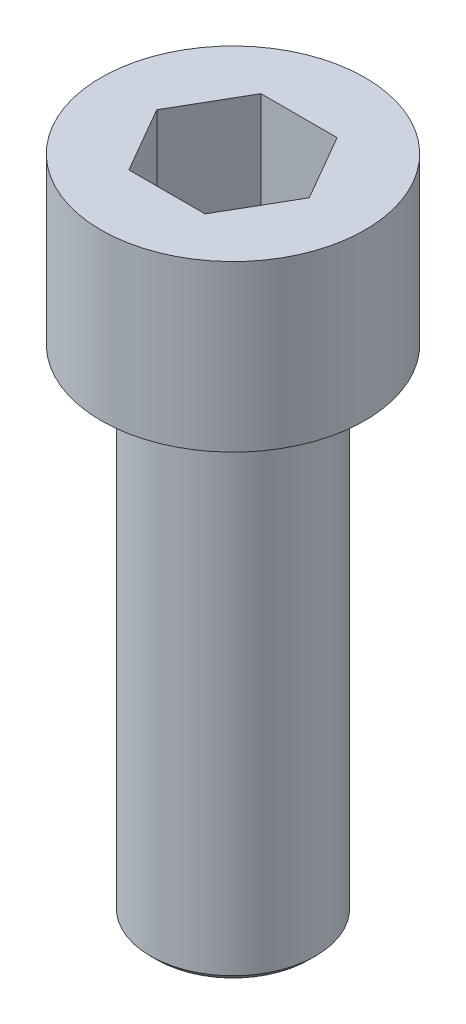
ISO-10303-21;
HEADER;
FILE_DESCRIPTION(('STEP AP214'),'2;1');
FILE_NAME('part.step','',(''),(''),'','','');
FILE_SCHEMA(('AUTOMOTIVE_DESIGN { 1 0 10303 214 1 1 1 1 }'));
ENDSEC;
DATA;
#1=APPLICATION_CONTEXT('core data for automotive mechanical design processes');
#2=APPLICATION_PROTOCOL_DEFINITION('international standard','automotive_design',2000,#1);
#3=PRODUCT_CONTEXT('',#1,'mechanical');
#4=PRODUCT('Part','Part','',(#3));
#5=PRODUCT_RELATED_PRODUCT_CATEGORY('part','',(#4));
#6=PRODUCT_DEFINITION_FORMATION('','',#4);
#7=PRODUCT_DEFINITION_CONTEXT('part definition',#1,'design');
#8=PRODUCT_DEFINITION('design','',#6,#7);
#9=PRODUCT_DEFINITION_SHAPE('','',#8);
#10=(LENGTH_UNIT() NAMED_UNIT(*) SI_UNIT(.MILLI.,.METRE.));
#11=(NAMED_UNIT(*) PLANE_ANGLE_UNIT() SI_UNIT($,.RADIAN.));
#12=(NAMED_UNIT(*) SI_UNIT($,.STERADIAN.) SOLID_ANGLE_UNIT());
#13=UNCERTAINTY_MEASURE_WITH_UNIT(LENGTH_MEASURE(1.E-05),#10,'distance_accuracy_value','');
#14=(GEOMETRIC_REPRESENTATION_CONTEXT(3) GLOBAL_UNCERTAINTY_ASSIGNED_CONTEXT((#13)) GLOBAL_UNIT_ASSIGNED_CONTEXT((#10,
#11,#12)) REPRESENTATION_CONTEXT('',''));
#15=CARTESIAN_POINT('',(0.,0.,0.));
#16=DIRECTION('',(0.,0.,1.));
#17=DIRECTION('',(1.,0.,0.));
#18=AXIS2_PLACEMENT_3D('',#15,#16,#17);
#19=CARTESIAN_POINT('',(0.,0.,0.));
#20=DIRECTION('',(0.,1.,0.));
#21=DIRECTION('',(0.,0.,1.));
#22=AXIS2_PLACEMENT_3D('',#19,#20,#21);
#23=PLANE('',#22);
#24=CARTESIAN_POINT('',(0.,0.,0.));
#25=DIRECTION('',(0.,1.,0.));
#26=DIRECTION('',(0.,0.,1.));
#27=AXIS2_PLACEMENT_3D('',#24,#25,#26);
#28=CIRCLE('',#27,2.30000000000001);
#29=CARTESIAN_POINT('',(0.,0.,2.30000000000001));
#30=VERTEX_POINT('',#29);
#31=EDGE_CURVE('E11',#30,#30,#28,.F.);
#32=ORIENTED_EDGE('',*,*,#31,.T.);
#33=EDGE_LOOP('',(#32));
#34=FACE_BOUND('',#33,.T.);
#35=ADVANCED_FACE('F31',(#34),#23,.F.);
#36=CARTESIAN_POINT('',(0.,124.161982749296,0.));
#37=DIRECTION('',(0.,1.,0.));
#38=DIRECTION('',(0.,0.,1.));
#39=AXIS2_PLACEMENT_3D('',#36,#37,#38);
#40=CYLINDRICAL_SURFACE('',#39,2.50000000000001);
#41=CARTESIAN_POINT('',(0.,0.200000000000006,0.));
#42=DIRECTION('',(0.,1.,0.));
#43=DIRECTION('',(0.,0.,1.));
#44=AXIS2_PLACEMENT_3D('',#41,#42,#43);
#45=CIRCLE('',#44,2.50000000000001);
#46=CARTESIAN_POINT('',(0.,0.200000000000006,2.50000000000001));
#47=VERTEX_POINT('',#46);
#48=EDGE_CURVE('E39',#47,#47,#45,.T.);
#49=ORIENTED_EDGE('',*,*,#48,.T.);
#50=EDGE_LOOP('',(#49));
#51=FACE_BOUND('',#50,.T.);
#52=CARTESIAN_POINT('',(0.,14.8,0.));
#53=DIRECTION('',(0.,1.,0.));
#54=DIRECTION('',(0.,0.,1.));
#55=AXIS2_PLACEMENT_3D('',#52,#53,#54);
#56=CIRCLE('',#55,2.50000000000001);
#57=CARTESIAN_POINT('',(0.,14.8,2.50000000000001));
#58=VERTEX_POINT('',#57);
#59=EDGE_CURVE('E147',#58,#58,#56,.F.);
#60=ORIENTED_EDGE('',*,*,#59,.T.);
#61=EDGE_LOOP('',(#60));
#62=FACE_BOUND('',#61,.T.);
#63=ADVANCED_FACE('F152',(#51,#62),#40,.T.);
#64=CARTESIAN_POINT('',(-2.50000000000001,15.,0.));
#65=DIRECTION('',(0.,1.,0.));
#66=DIRECTION('',(0.,0.,1.));
#67=AXIS2_PLACEMENT_3D('',#64,#65,#66);
#68=PLANE('',#67);
#69=CARTESIAN_POINT('',(0.,15.,0.));
#70=DIRECTION('',(0.,1.,0.));
#71=DIRECTION('',(0.,0.,1.));
#72=AXIS2_PLACEMENT_3D('',#69,#70,#71);
#73=CIRCLE('',#72,2.70000000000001);
#74=CARTESIAN_POINT('',(0.,15.,2.70000000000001));
#75=VERTEX_POINT('',#74);
#76=EDGE_CURVE('E144',#75,#75,#73,.T.);
#77=ORIENTED_EDGE('',*,*,#76,.T.);
#78=EDGE_LOOP('',(#77));
#79=FACE_BOUND('',#78,.T.);
#80=CARTESIAN_POINT('',(0.,15.,0.));
#81=DIRECTION('',(0.,1.,0.));
#82=DIRECTION('',(0.,0.,1.));
#83=AXIS2_PLACEMENT_3D('',#80,#81,#82);
#84=CIRCLE('',#83,4.);
#85=CARTESIAN_POINT('',(0.,15.,4.));
#86=VERTEX_POINT('',#85);
#87=EDGE_CURVE('E141',#86,#86,#84,.T.);
#88=ORIENTED_EDGE('',*,*,#87,.F.);
#89=EDGE_LOOP('',(#88));
#90=FACE_BOUND('',#89,.T.);
#91=ADVANCED_FACE('F169',(#79,#90),#68,.F.);
#92=CARTESIAN_POINT('',(0.,124.161982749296,0.));
#93=DIRECTION('',(0.,1.,0.));
#94=DIRECTION('',(0.,0.,1.));
#95=AXIS2_PLACEMENT_3D('',#92,#93,#94);
#96=CYLINDRICAL_SURFACE('',#95,4.);
#97=CARTESIAN_POINT('',(0.,20.,0.));
#98=DIRECTION('',(0.,1.,0.));
#99=DIRECTION('',(0.,0.,1.));
#100=AXIS2_PLACEMENT_3D('',#97,#98,#99);
#101=CIRCLE('',#100,4.);
#102=CARTESIAN_POINT('',(0.,20.,4.));
#103=VERTEX_POINT('',#102);
#104=EDGE_CURVE('E133',#103,#103,#101,.T.);
#105=ORIENTED_EDGE('',*,*,#104,.F.);
#106=EDGE_LOOP('',(#105));
#107=FACE_BOUND('',#106,.T.);
#108=ORIENTED_EDGE('',*,*,#87,.T.);
#109=EDGE_LOOP('',(#108));
#110=FACE_BOUND('',#109,.T.);
#111=ADVANCED_FACE('F174',(#107,#110),#96,.T.);
#112=CARTESIAN_POINT('',(-4.,20.,0.));
#113=DIRECTION('',(0.,-1.,0.));
#114=DIRECTION('',(0.,0.,-1.));
#115=AXIS2_PLACEMENT_3D('',#112,#113,#114);
#116=PLANE('',#115);
#117=DIRECTION('',(-0.500000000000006,0.,-0.866025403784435));
#118=VECTOR('',#117,1.);
#119=CARTESIAN_POINT('',(2.30940107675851,20.,0.));
#120=LINE('',#119,#118);
#121=CARTESIAN_POINT('',(2.30940107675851,20.,0.));
#122=VERTEX_POINT('',#121);
#123=CARTESIAN_POINT('',(1.15470053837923,20.,-2.00000000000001));
#124=VERTEX_POINT('',#123);
#125=EDGE_CURVE('E120',#122,#124,#120,.T.);
#126=ORIENTED_EDGE('',*,*,#125,.F.);
#127=DIRECTION('',(0.499999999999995,0.,-0.866025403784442));
#128=VECTOR('',#127,1.);
#129=CARTESIAN_POINT('',(1.15470053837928,20.,1.99999999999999));
#130=LINE('',#129,#128);
#131=CARTESIAN_POINT('',(1.15470053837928,20.,1.99999999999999));
#132=VERTEX_POINT('',#131);
#133=EDGE_CURVE('E46',#132,#122,#130,.T.);
#134=ORIENTED_EDGE('',*,*,#133,.F.);
#135=DIRECTION('',(1.,0.,0.));
#136=VECTOR('',#135,1.);
#137=CARTESIAN_POINT('',(-1.15470053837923,20.,2.00000000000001));
#138=LINE('',#137,#136);
#139=CARTESIAN_POINT('',(-1.15470053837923,20.,2.00000000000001));
#140=VERTEX_POINT('',#139);
#141=EDGE_CURVE('E129',#140,#132,#138,.T.);
#142=ORIENTED_EDGE('',*,*,#141,.F.);
#143=DIRECTION('',(0.500000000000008,0.,0.866025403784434));
#144=VECTOR('',#143,1.);
#145=CARTESIAN_POINT('',(-2.3094010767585,20.,0.));
#146=LINE('',#145,#144);
#147=CARTESIAN_POINT('',(-2.3094010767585,20.,0.));
#148=VERTEX_POINT('',#147);
#149=EDGE_CURVE('E127',#148,#140,#146,.T.);
#150=ORIENTED_EDGE('',*,*,#149,.F.);
#151=DIRECTION('',(-0.499999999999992,0.,0.866025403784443));
#152=VECTOR('',#151,1.);
#153=CARTESIAN_POINT('',(-1.15470053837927,20.,-1.99999999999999));
#154=LINE('',#153,#152);
#155=CARTESIAN_POINT('',(-1.15470053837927,20.,-1.99999999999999));
#156=VERTEX_POINT('',#155);
#157=EDGE_CURVE('E94',#156,#148,#154,.T.);
#158=ORIENTED_EDGE('',*,*,#157,.F.);
#159=DIRECTION('',(-1.,0.,0.));
#160=VECTOR('',#159,1.);
#161=CARTESIAN_POINT('',(1.15470053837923,20.,-2.00000000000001));
#162=LINE('',#161,#160);
#163=EDGE_CURVE('E123',#124,#156,#162,.T.);
#164=ORIENTED_EDGE('',*,*,#163,.F.);
#165=EDGE_LOOP('',(#126,#134,#142,#150,#158,#164));
#166=FACE_BOUND('',#165,.T.);
#167=ORIENTED_EDGE('',*,*,#104,.T.);
#168=EDGE_LOOP('',(#167));
#169=FACE_BOUND('',#168,.T.);
#170=ADVANCED_FACE('F178',(#166,#169),#116,.F.);
#171=CARTESIAN_POINT('',(1.15470053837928,17.,1.99999999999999));
#172=DIRECTION('',(0.866025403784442,0.,0.499999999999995));
#173=DIRECTION('',(0.499999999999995,0.,-0.866025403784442));
#174=AXIS2_PLACEMENT_3D('',#171,#172,#173);
#175=PLANE('',#174);
#176=ORIENTED_EDGE('',*,*,#133,.T.);
#177=DIRECTION('',(0.,1.,0.));
#178=VECTOR('',#177,1.);
#179=CARTESIAN_POINT('',(2.30940107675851,17.,0.));
#180=LINE('',#179,#178);
#181=CARTESIAN_POINT('',(2.30940107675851,17.,0.));
#182=VERTEX_POINT('',#181);
#183=EDGE_CURVE('E76',#182,#122,#180,.T.);
#184=ORIENTED_EDGE('',*,*,#183,.F.);
#185=DIRECTION('',(0.499999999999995,0.,-0.866025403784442));
#186=VECTOR('',#185,1.);
#187=CARTESIAN_POINT('',(1.15470053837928,17.,1.99999999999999));
#188=LINE('',#187,#186);
#189=CARTESIAN_POINT('',(1.15470053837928,17.,1.99999999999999));
#190=VERTEX_POINT('',#189);
#191=EDGE_CURVE('E131',#190,#182,#188,.T.);
#192=ORIENTED_EDGE('',*,*,#191,.F.);
#193=DIRECTION('',(0.,1.,0.));
#194=VECTOR('',#193,1.);
#195=CARTESIAN_POINT('',(1.15470053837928,17.,1.99999999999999));
#196=LINE('',#195,#194);
#197=EDGE_CURVE('E54',#190,#132,#196,.T.);
#198=ORIENTED_EDGE('',*,*,#197,.T.);
#199=EDGE_LOOP('',(#176,#184,#192,#198));
#200=FACE_BOUND('',#199,.T.);
#201=ADVANCED_FACE('F182',(#200),#175,.F.);
#202=CARTESIAN_POINT('',(-1.15470053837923,17.,2.00000000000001));
#203=DIRECTION('',(0.,0.,1.));
#204=DIRECTION('',(1.,0.,0.));
#205=AXIS2_PLACEMENT_3D('',#202,#203,#204);
#206=PLANE('',#205);
#207=ORIENTED_EDGE('',*,*,#141,.T.);
#208=ORIENTED_EDGE('',*,*,#197,.F.);
#209=DIRECTION('',(1.,0.,0.));
#210=VECTOR('',#209,1.);
#211=CARTESIAN_POINT('',(-1.15470053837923,17.,2.00000000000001));
#212=LINE('',#211,#210);
#213=CARTESIAN_POINT('',(-1.15470053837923,17.,2.00000000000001));
#214=VERTEX_POINT('',#213);
#215=EDGE_CURVE('E106',#214,#190,#212,.T.);
#216=ORIENTED_EDGE('',*,*,#215,.F.);
#217=DIRECTION('',(0.,1.,0.));
#218=VECTOR('',#217,1.);
#219=CARTESIAN_POINT('',(-1.15470053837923,17.,2.00000000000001));
#220=LINE('',#219,#218);
#221=EDGE_CURVE('E98',#214,#140,#220,.T.);
#222=ORIENTED_EDGE('',*,*,#221,.T.);
#223=EDGE_LOOP('',(#207,#208,#216,#222));
#224=FACE_BOUND('',#223,.T.);
#225=ADVANCED_FACE('F186',(#224),#206,.F.);
#226=CARTESIAN_POINT('',(-2.3094010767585,17.,0.));
#227=DIRECTION('',(-0.866025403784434,0.,0.500000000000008));
#228=DIRECTION('',(0.500000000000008,0.,0.866025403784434));
#229=AXIS2_PLACEMENT_3D('',#226,#227,#228);
#230=PLANE('',#229);
#231=ORIENTED_EDGE('',*,*,#149,.T.);
#232=ORIENTED_EDGE('',*,*,#221,.F.);
#233=DIRECTION('',(0.500000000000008,0.,0.866025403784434));
#234=VECTOR('',#233,1.);
#235=CARTESIAN_POINT('',(-2.3094010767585,17.,0.));
#236=LINE('',#235,#234);
#237=CARTESIAN_POINT('',(-2.3094010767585,17.,0.));
#238=VERTEX_POINT('',#237);
#239=EDGE_CURVE('E102',#238,#214,#236,.T.);
#240=ORIENTED_EDGE('',*,*,#239,.F.);
#241=DIRECTION('',(0.,1.,0.));
#242=VECTOR('',#241,1.);
#243=CARTESIAN_POINT('',(-2.3094010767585,17.,0.));
#244=LINE('',#243,#242);
#245=EDGE_CURVE('E87',#238,#148,#244,.T.);
#246=ORIENTED_EDGE('',*,*,#245,.T.);
#247=EDGE_LOOP('',(#231,#232,#240,#246));
#248=FACE_BOUND('',#247,.T.);
#249=ADVANCED_FACE('F103',(#248),#230,.F.);
#250=CARTESIAN_POINT('',(-1.15470053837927,17.,-1.99999999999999));
#251=DIRECTION('',(-0.866025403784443,0.,-0.499999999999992));
#252=DIRECTION('',(-0.499999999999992,0.,0.866025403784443));
#253=AXIS2_PLACEMENT_3D('',#250,#251,#252);
#254=PLANE('',#253);
#255=ORIENTED_EDGE('',*,*,#157,.T.);
#256=ORIENTED_EDGE('',*,*,#245,.F.);
#257=DIRECTION('',(-0.499999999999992,0.,0.866025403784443));
#258=VECTOR('',#257,1.);
#259=CARTESIAN_POINT('',(-1.15470053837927,17.,-1.99999999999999));
#260=LINE('',#259,#258);
#261=CARTESIAN_POINT('',(-1.15470053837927,17.,-1.99999999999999));
#262=VERTEX_POINT('',#261);
#263=EDGE_CURVE('E91',#262,#238,#260,.T.);
#264=ORIENTED_EDGE('',*,*,#263,.F.);
#265=DIRECTION('',(0.,1.,0.));
#266=VECTOR('',#265,1.);
#267=CARTESIAN_POINT('',(-1.15470053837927,17.,-1.99999999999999));
#268=LINE('',#267,#266);
#269=EDGE_CURVE('E99',#262,#156,#268,.T.);
#270=ORIENTED_EDGE('',*,*,#269,.T.);
#271=EDGE_LOOP('',(#255,#256,#264,#270));
#272=FACE_BOUND('',#271,.T.);
#273=ADVANCED_FACE('F89',(#272),#254,.F.);
#274=CARTESIAN_POINT('',(1.15470053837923,17.,-2.00000000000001));
#275=DIRECTION('',(0.,0.,-1.));
#276=DIRECTION('',(-1.,0.,0.));
#277=AXIS2_PLACEMENT_3D('',#274,#275,#276);
#278=PLANE('',#277);
#279=ORIENTED_EDGE('',*,*,#163,.T.);
#280=ORIENTED_EDGE('',*,*,#269,.F.);
#281=DIRECTION('',(-1.,0.,0.));
#282=VECTOR('',#281,1.);
#283=CARTESIAN_POINT('',(1.15470053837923,17.,-2.00000000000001));
#284=LINE('',#283,#282);
#285=CARTESIAN_POINT('',(1.15470053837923,17.,-2.00000000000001));
#286=VERTEX_POINT('',#285);
#287=EDGE_CURVE('E112',#286,#262,#284,.T.);
#288=ORIENTED_EDGE('',*,*,#287,.F.);
#289=DIRECTION('',(0.,1.,0.));
#290=VECTOR('',#289,1.);
#291=CARTESIAN_POINT('',(1.15470053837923,17.,-2.00000000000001));
#292=LINE('',#291,#290);
#293=EDGE_CURVE('E136',#286,#124,#292,.T.);
#294=ORIENTED_EDGE('',*,*,#293,.T.);
#295=EDGE_LOOP('',(#279,#280,#288,#294));
#296=FACE_BOUND('',#295,.T.);
#297=ADVANCED_FACE('F190',(#296),#278,.F.);
#298=CARTESIAN_POINT('',(2.30940107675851,17.,0.));
#299=DIRECTION('',(0.866025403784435,0.,-0.500000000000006));
#300=DIRECTION('',(-0.500000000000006,0.,-0.866025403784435));
#301=AXIS2_PLACEMENT_3D('',#298,#299,#300);
#302=PLANE('',#301);
#303=ORIENTED_EDGE('',*,*,#125,.T.);
#304=ORIENTED_EDGE('',*,*,#293,.F.);
#305=DIRECTION('',(-0.500000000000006,0.,-0.866025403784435));
#306=VECTOR('',#305,1.);
#307=CARTESIAN_POINT('',(2.30940107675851,17.,0.));
#308=LINE('',#307,#306);
#309=EDGE_CURVE('E114',#182,#286,#308,.T.);
#310=ORIENTED_EDGE('',*,*,#309,.F.);
#311=ORIENTED_EDGE('',*,*,#183,.T.);
#312=EDGE_LOOP('',(#303,#304,#310,#311));
#313=FACE_BOUND('',#312,.T.);
#314=ADVANCED_FACE('F187',(#313),#302,.F.);
#315=CARTESIAN_POINT('',(2.30940107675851,17.,0.));
#316=DIRECTION('',(0.,1.,0.));
#317=DIRECTION('',(0.,0.,1.));
#318=AXIS2_PLACEMENT_3D('',#315,#316,#317);
#319=PLANE('',#318);
#320=ORIENTED_EDGE('',*,*,#191,.T.);
#321=ORIENTED_EDGE('',*,*,#309,.T.);
#322=ORIENTED_EDGE('',*,*,#287,.T.);
#323=ORIENTED_EDGE('',*,*,#263,.T.);
#324=ORIENTED_EDGE('',*,*,#239,.T.);
#325=ORIENTED_EDGE('',*,*,#215,.T.);
#326=EDGE_LOOP('',(#320,#321,#322,#323,#324,#325));
#327=FACE_BOUND('',#326,.T.);
#328=ADVANCED_FACE('F109',(#327),#319,.T.);
#329=CARTESIAN_POINT('',(0.,14.8,0.));
#330=DIRECTION('',(0.,1.,0.));
#331=DIRECTION('',(0.,0.,1.));
#332=AXIS2_PLACEMENT_3D('',#329,#330,#331);
#333=TOROIDAL_SURFACE('',#332,2.70000000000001,0.2);
#334=ORIENTED_EDGE('',*,*,#59,.F.);
#335=EDGE_LOOP('',(#334));
#336=FACE_BOUND('',#335,.T.);
#337=ORIENTED_EDGE('',*,*,#76,.F.);
#338=EDGE_LOOP('',(#337));
#339=FACE_BOUND('',#338,.T.);
#340=ADVANCED_FACE('F156',(#336,#339),#333,.F.);
#341=CARTESIAN_POINT('',(0.,0.200000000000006,0.));
#342=DIRECTION('',(0.,1.,0.));
#343=DIRECTION('',(0.,0.,1.));
#344=AXIS2_PLACEMENT_3D('',#341,#342,#343);
#345=CONICAL_SURFACE('',#344,2.50000000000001,0.785398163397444);
#346=ORIENTED_EDGE('',*,*,#31,.F.);
#347=EDGE_LOOP('',(#346));
#348=FACE_BOUND('',#347,.T.);
#349=ORIENTED_EDGE('',*,*,#48,.F.);
#350=EDGE_LOOP('',(#349));
#351=FACE_BOUND('',#350,.T.);
#352=ADVANCED_FACE('F33',(#348,#351),#345,.T.);
#353=CLOSED_SHELL('',(#35,#63,#91,#111,#170,#201,#225,#249,#273,#297,#314,#328,#340,#352));
#354=MANIFOLD_SOLID_BREP('B2',#353);
#355=ADVANCED_BREP_SHAPE_REPRESENTATION('',(#18,#354),#14);
#356=SHAPE_DEFINITION_REPRESENTATION(#9,#355);
ENDSEC;
END-ISO-10303-21;
